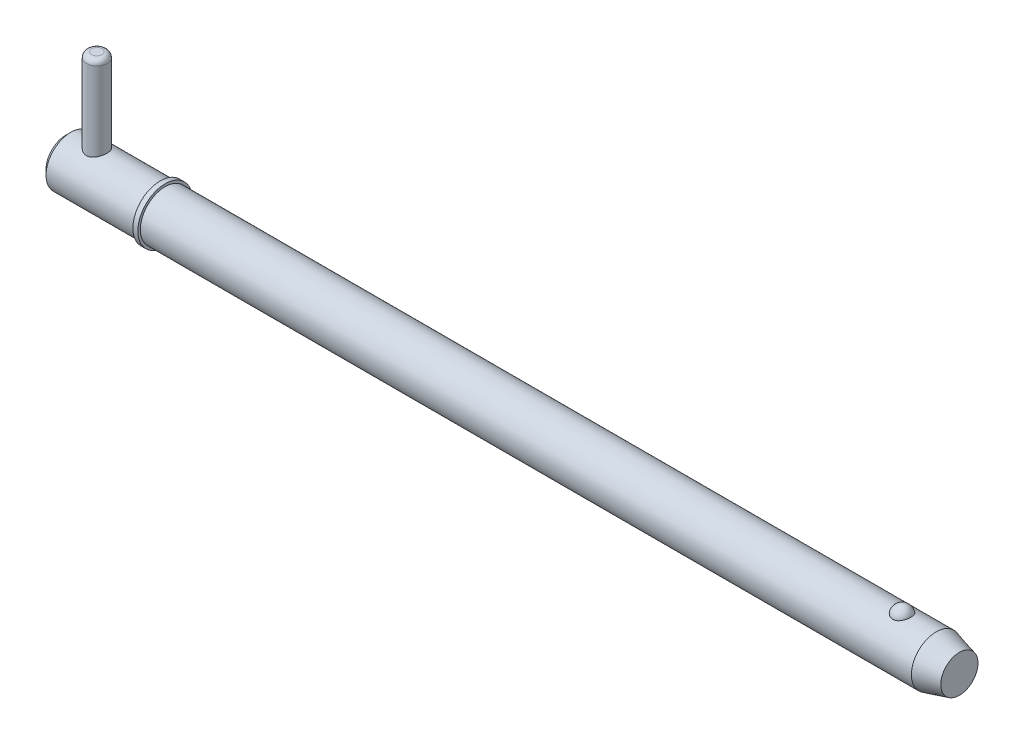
ISO-10303-21;
HEADER;
FILE_DESCRIPTION(('STEP AP214'),'2;1');
FILE_NAME('part.step','',(''),(''),'','','');
FILE_SCHEMA(('AUTOMOTIVE_DESIGN { 1 0 10303 214 1 1 1 1 }'));
ENDSEC;
DATA;
#1=APPLICATION_CONTEXT('core data for automotive mechanical design processes');
#2=APPLICATION_PROTOCOL_DEFINITION('international standard','automotive_design',2000,#1);
#3=PRODUCT_CONTEXT('',#1,'mechanical');
#4=PRODUCT('Part','Part','',(#3));
#5=PRODUCT_RELATED_PRODUCT_CATEGORY('part','',(#4));
#6=PRODUCT_DEFINITION_FORMATION('','',#4);
#7=PRODUCT_DEFINITION_CONTEXT('part definition',#1,'design');
#8=PRODUCT_DEFINITION('design','',#6,#7);
#9=PRODUCT_DEFINITION_SHAPE('','',#8);
#10=(LENGTH_UNIT() NAMED_UNIT(*) SI_UNIT(.MILLI.,.METRE.));
#11=(NAMED_UNIT(*) PLANE_ANGLE_UNIT() SI_UNIT($,.RADIAN.));
#12=(NAMED_UNIT(*) SI_UNIT($,.STERADIAN.) SOLID_ANGLE_UNIT());
#13=UNCERTAINTY_MEASURE_WITH_UNIT(LENGTH_MEASURE(1.E-05),#10,'distance_accuracy_value','');
#14=(GEOMETRIC_REPRESENTATION_CONTEXT(3) GLOBAL_UNCERTAINTY_ASSIGNED_CONTEXT((#13)) GLOBAL_UNIT_ASSIGNED_CONTEXT((#10,
#11,#12)) REPRESENTATION_CONTEXT('',''));
#15=CARTESIAN_POINT('',(0.,0.,0.));
#16=DIRECTION('',(0.,0.,1.));
#17=DIRECTION('',(1.,0.,0.));
#18=AXIS2_PLACEMENT_3D('',#15,#16,#17);
#19=CARTESIAN_POINT('',(5.94,20.635,0.));
#20=DIRECTION('',(0.,-1.,0.));
#21=DIRECTION('',(0.,0.,-1.));
#22=AXIS2_PLACEMENT_3D('',#19,#20,#21);
#23=CYLINDRICAL_SURFACE('',#22,1.98);
#24=CARTESIAN_POINT('',(5.94,-3.775,0.));
#25=DIRECTION('',(0.,1.,0.));
#26=DIRECTION('',(0.,0.,1.));
#27=AXIS2_PLACEMENT_3D('',#24,#25,#26);
#28=CIRCLE('',#27,1.98);
#29=CARTESIAN_POINT('',(5.94,-3.775,1.98));
#30=VERTEX_POINT('',#29);
#31=EDGE_CURVE('P0_E25',#30,#30,#28,.T.);
#32=ORIENTED_EDGE('',*,*,#31,.T.);
#33=EDGE_LOOP('',(#32));
#34=FACE_BOUND('',#33,.T.);
#35=CARTESIAN_POINT('',(5.94,19.645,0.));
#36=DIRECTION('',(0.,1.,0.));
#37=DIRECTION('',(0.,0.,1.));
#38=AXIS2_PLACEMENT_3D('',#35,#36,#37);
#39=CIRCLE('',#38,1.98);
#40=CARTESIAN_POINT('',(5.94,19.645,1.98));
#41=VERTEX_POINT('',#40);
#42=EDGE_CURVE('P0_E29',#41,#41,#39,.F.);
#43=ORIENTED_EDGE('',*,*,#42,.T.);
#44=EDGE_LOOP('',(#43));
#45=FACE_BOUND('',#44,.T.);
#46=ADVANCED_FACE('P0_F14',(#34,#45),#23,.T.);
#47=CARTESIAN_POINT('',(5.94,20.635,0.));
#48=DIRECTION('',(0.,1.,0.));
#49=DIRECTION('',(0.,0.,1.));
#50=AXIS2_PLACEMENT_3D('',#47,#48,#49);
#51=PLANE('',#50);
#52=CARTESIAN_POINT('',(5.94,20.635,0.));
#53=DIRECTION('',(0.,1.,0.));
#54=DIRECTION('',(0.,0.,1.));
#55=AXIS2_PLACEMENT_3D('',#52,#53,#54);
#56=CIRCLE('',#55,0.99);
#57=CARTESIAN_POINT('',(5.94,20.635,0.99));
#58=VERTEX_POINT('',#57);
#59=EDGE_CURVE('P0_E10',#58,#58,#56,.T.);
#60=ORIENTED_EDGE('',*,*,#59,.T.);
#61=EDGE_LOOP('',(#60));
#62=FACE_BOUND('',#61,.T.);
#63=ADVANCED_FACE('P0_F46',(#62),#51,.T.);
#64=CARTESIAN_POINT('',(5.94,-4.765,0.));
#65=DIRECTION('',(0.,1.,0.));
#66=DIRECTION('',(0.,0.,1.));
#67=AXIS2_PLACEMENT_3D('',#64,#65,#66);
#68=PLANE('',#67);
#69=CARTESIAN_POINT('',(5.94,-4.765,0.));
#70=DIRECTION('',(0.,1.,0.));
#71=DIRECTION('',(0.,0.,1.));
#72=AXIS2_PLACEMENT_3D('',#69,#70,#71);
#73=CIRCLE('',#72,0.99);
#74=CARTESIAN_POINT('',(5.94,-4.765,0.99));
#75=VERTEX_POINT('',#74);
#76=EDGE_CURVE('P0_E21',#75,#75,#73,.F.);
#77=ORIENTED_EDGE('',*,*,#76,.T.);
#78=EDGE_LOOP('',(#77));
#79=FACE_BOUND('',#78,.T.);
#80=ADVANCED_FACE('P0_F43',(#79),#68,.F.);
#81=CARTESIAN_POINT('',(5.94,-3.775,0.));
#82=DIRECTION('',(0.,1.,0.));
#83=DIRECTION('',(0.,0.,1.));
#84=AXIS2_PLACEMENT_3D('',#81,#82,#83);
#85=DEGENERATE_TOROIDAL_SURFACE('',#84,0.99,0.99,.T.);
#86=ORIENTED_EDGE('',*,*,#76,.F.);
#87=EDGE_LOOP('',(#86));
#88=FACE_BOUND('',#87,.T.);
#89=ORIENTED_EDGE('',*,*,#31,.F.);
#90=EDGE_LOOP('',(#89));
#91=FACE_BOUND('',#90,.T.);
#92=ADVANCED_FACE('P0_F38',(#88,#91),#85,.T.);
#93=CARTESIAN_POINT('',(5.94,19.645,0.));
#94=DIRECTION('',(0.,1.,0.));
#95=DIRECTION('',(0.,0.,1.));
#96=AXIS2_PLACEMENT_3D('',#93,#94,#95);
#97=DEGENERATE_TOROIDAL_SURFACE('',#96,0.99,0.99,.T.);
#98=ORIENTED_EDGE('',*,*,#42,.F.);
#99=EDGE_LOOP('',(#98));
#100=FACE_BOUND('',#99,.T.);
#101=ORIENTED_EDGE('',*,*,#59,.F.);
#102=EDGE_LOOP('',(#101));
#103=FACE_BOUND('',#102,.T.);
#104=ADVANCED_FACE('P0_F16',(#100,#103),#97,.T.);
#105=CLOSED_SHELL('',(#46,#63,#80,#92,#104));
#106=MANIFOLD_SOLID_BREP('P0_B1',#105);
#107=CARTESIAN_POINT('',(0.,0.,0.));
#108=DIRECTION('',(1.,0.,0.));
#109=DIRECTION('',(0.,0.,-1.));
#110=AXIS2_PLACEMENT_3D('',#107,#108,#109);
#111=CYLINDRICAL_SURFACE('',#110,4.765);
#112=CARTESIAN_POINT('',(167.004194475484,0.,0.));
#113=DIRECTION('',(1.,0.,0.));
#114=DIRECTION('',(0.,0.,-1.));
#115=AXIS2_PLACEMENT_3D('',#112,#113,#114);
#116=CIRCLE('',#115,4.765);
#117=CARTESIAN_POINT('',(167.004194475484,0.,-4.765));
#118=VERTEX_POINT('',#117);
#119=EDGE_CURVE('P1_E81',#118,#118,#116,.T.);
#120=ORIENTED_EDGE('',*,*,#119,.F.);
#121=EDGE_LOOP('',(#120));
#122=FACE_BOUND('',#121,.T.);
#123=CARTESIAN_POINT('',(19.05,0.,0.));
#124=DIRECTION('',(1.,0.,0.));
#125=DIRECTION('',(0.,0.,-1.));
#126=AXIS2_PLACEMENT_3D('',#123,#124,#125);
#127=CIRCLE('',#126,4.765);
#128=CARTESIAN_POINT('',(19.05,0.,-4.765));
#129=VERTEX_POINT('',#128);
#130=EDGE_CURVE('P1_E85',#129,#129,#127,.T.);
#131=ORIENTED_EDGE('',*,*,#130,.T.);
#132=EDGE_LOOP('',(#131));
#133=FACE_BOUND('',#132,.T.);
#134=CARTESIAN_POINT('',(160.451020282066,4.42764777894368,1.76101111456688));
#135=CARTESIAN_POINT('',(160.359721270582,4.42764470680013,1.76101422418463));
#136=CARTESIAN_POINT('',(160.268446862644,4.43059091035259,1.75366340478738));
#137=CARTESIAN_POINT('',(160.088615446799,4.44201846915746,1.72451180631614));
#138=CARTESIAN_POINT('',(160.000057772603,4.45049845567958,1.70271460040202));
#139=CARTESIAN_POINT('',(159.828257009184,4.47200516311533,1.64539370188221));
#140=CARTESIAN_POINT('',(159.745006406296,4.48502527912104,1.60988994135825));
#141=CARTESIAN_POINT('',(159.585763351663,4.51419542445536,1.52617873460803));
#142=CARTESIAN_POINT('',(159.509772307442,4.53034605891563,1.47796883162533));
#143=CARTESIAN_POINT('',(159.364744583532,4.56459317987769,1.36860494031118));
#144=CARTESIAN_POINT('',(159.295964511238,4.58273170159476,1.30712420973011));
#145=CARTESIAN_POINT('',(159.169342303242,4.61870302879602,1.17370204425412));
#146=CARTESIAN_POINT('',(159.111502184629,4.63653577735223,1.10175868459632));
#147=CARTESIAN_POINT('',(159.005570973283,4.67090140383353,0.945806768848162));
#148=CARTESIAN_POINT('',(158.958030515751,4.68734068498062,0.861402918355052));
#149=CARTESIAN_POINT('',(158.877081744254,4.71628466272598,0.685442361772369));
#150=CARTESIAN_POINT('',(158.843674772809,4.72878898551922,0.593884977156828));
#151=CARTESIAN_POINT('',(158.791287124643,4.74874061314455,0.404781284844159));
#152=CARTESIAN_POINT('',(158.772517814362,4.75611366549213,0.307168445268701));
#153=CARTESIAN_POINT('',(158.750584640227,4.76475393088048,0.109940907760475));
#154=CARTESIAN_POINT('',(158.747420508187,4.76602124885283,0.0103262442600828));
#155=CARTESIAN_POINT('',(158.756740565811,4.76232928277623,-0.187629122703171));
#156=CARTESIAN_POINT('',(158.769158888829,4.7573962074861,-0.285973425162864));
#157=CARTESIAN_POINT('',(158.809280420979,4.74184975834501,-0.479027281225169));
#158=CARTESIAN_POINT('',(158.836983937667,4.7312362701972,-0.573736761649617));
#159=CARTESIAN_POINT('',(158.907158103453,4.70540026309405,-0.756973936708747));
#160=CARTESIAN_POINT('',(158.949646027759,4.69017235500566,-0.845494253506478));
#161=CARTESIAN_POINT('',(159.048520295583,4.65669867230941,-1.01378033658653));
#162=CARTESIAN_POINT('',(159.104907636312,4.63845268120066,-1.09354547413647));
#163=CARTESIAN_POINT('',(159.230552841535,4.60085438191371,-1.24228523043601));
#164=CARTESIAN_POINT('',(159.299843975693,4.58149930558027,-1.31123108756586));
#165=CARTESIAN_POINT('',(159.449606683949,4.54391653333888,-1.43607409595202));
#166=CARTESIAN_POINT('',(159.530077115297,4.52568872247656,-1.49197257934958));
#167=CARTESIAN_POINT('',(159.698150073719,4.49293007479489,-1.58786764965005));
#168=CARTESIAN_POINT('',(159.785544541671,4.47832346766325,-1.62820219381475));
#169=CARTESIAN_POINT('',(159.966553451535,4.45406011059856,-1.69345757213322));
#170=CARTESIAN_POINT('',(160.06016555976,4.44440151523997,-1.71838415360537));
#171=CARTESIAN_POINT('',(160.245893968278,4.43159888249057,-1.75112843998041));
#172=CARTESIAN_POINT('',(160.337849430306,4.42815213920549,-1.75974223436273));
#173=CARTESIAN_POINT('',(160.521965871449,4.427247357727,-1.76201865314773));
#174=CARTESIAN_POINT('',(160.614126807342,4.42978816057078,-1.7556841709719));
#175=CARTESIAN_POINT('',(160.793129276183,4.44038648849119,-1.72869560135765));
#176=CARTESIAN_POINT('',(160.880047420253,4.44827555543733,-1.70847853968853));
#177=CARTESIAN_POINT('',(161.049131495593,4.46852246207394,-1.65479562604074));
#178=CARTESIAN_POINT('',(161.131297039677,4.48088066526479,-1.62132869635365));
#179=CARTESIAN_POINT('',(161.290591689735,4.50907357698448,-1.54120560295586));
#180=CARTESIAN_POINT('',(161.367570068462,4.52497884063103,-1.49427526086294));
#181=CARTESIAN_POINT('',(161.512708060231,4.55845148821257,-1.38881222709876));
#182=CARTESIAN_POINT('',(161.580865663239,4.57601924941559,-1.33027689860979));
#183=CARTESIAN_POINT('',(161.710099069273,4.61196537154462,-1.1999104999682));
#184=CARTESIAN_POINT('',(161.770656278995,4.63034074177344,-1.12756415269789));
#185=CARTESIAN_POINT('',(161.879279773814,4.66513959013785,-0.97361299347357));
#186=CARTESIAN_POINT('',(161.927343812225,4.68156271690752,-0.892006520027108));
#187=CARTESIAN_POINT('',(162.011383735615,4.71130224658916,-0.718892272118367));
#188=CARTESIAN_POINT('',(162.046918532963,4.724501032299,-0.627149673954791));
#189=CARTESIAN_POINT('',(162.102952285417,4.74571823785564,-0.438611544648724));
#190=CARTESIAN_POINT('',(162.123450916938,4.75373654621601,-0.34181590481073));
#191=CARTESIAN_POINT('',(162.149033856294,4.76378905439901,-0.14563306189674));
#192=CARTESIAN_POINT('',(162.154076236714,4.76580697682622,-0.0462395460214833));
#193=CARTESIAN_POINT('',(162.148523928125,4.7636057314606,0.152038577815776));
#194=CARTESIAN_POINT('',(162.137929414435,4.75938663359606,0.250923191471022));
#195=CARTESIAN_POINT('',(162.101387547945,4.74516937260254,0.445004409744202));
#196=CARTESIAN_POINT('',(162.075496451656,4.73519238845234,0.540213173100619));
#197=CARTESIAN_POINT('',(162.008927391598,4.71049394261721,0.724662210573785));
#198=CARTESIAN_POINT('',(161.968248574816,4.69577220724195,0.813902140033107));
#199=CARTESIAN_POINT('',(161.872717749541,4.66303767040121,0.984313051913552));
#200=CARTESIAN_POINT('',(161.817804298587,4.64501070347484,1.06544688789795));
#201=CARTESIAN_POINT('',(161.695049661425,4.60764678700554,1.21692673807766));
#202=CARTESIAN_POINT('',(161.627208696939,4.58830985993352,1.28727293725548));
#203=CARTESIAN_POINT('',(161.480548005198,4.55060370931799,1.41479271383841));
#204=CARTESIAN_POINT('',(161.401791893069,4.53222967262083,1.47203785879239));
#205=CARTESIAN_POINT('',(161.234989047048,4.49849576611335,1.57212016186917));
#206=CARTESIAN_POINT('',(161.146941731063,4.48313608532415,1.6149564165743));
#207=CARTESIAN_POINT('',(160.959791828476,4.45676184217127,1.68642657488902));
#208=CARTESIAN_POINT('',(160.860365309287,4.44598302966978,1.71430590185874));
#209=CARTESIAN_POINT('',(160.657621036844,4.43142918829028,1.7515925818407));
#210=CARTESIAN_POINT('',(160.554304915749,4.42765125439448,1.76100759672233));
#211=CARTESIAN_POINT('',(160.451020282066,4.42764777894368,1.76101111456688));
#212=B_SPLINE_CURVE_WITH_KNOTS('',3,(#134,#135,#136,#137,#138,#139,#140,#141,#142,#143,#144,
#145,#146,#147,#148,#149,#150,#151,#152,#153,#154,#155,#156,#157,#158,#159,#160,#161,#162,#163,
#164,#165,#166,#167,#168,#169,#170,#171,#172,#173,#174,#175,#176,#177,#178,#179,#180,#181,#182,
#183,#184,#185,#186,#187,#188,#189,#190,#191,#192,#193,#194,#195,#196,#197,#198,#199,#200,#201,
#202,#203,#204,#205,#206,#207,#208,#209,#210,#211),.UNSPECIFIED.,.T.,.F.,(4,2,2,2,2,2,2,2,2,2,2,
2,2,2,2,2,2,2,2,2,2,2,2,2,2,2,2,2,2,2,2,2,2,2,2,2,2,2,4),(0.,0.273517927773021,
0.546968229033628,0.820022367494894,1.09312934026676,1.37393946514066,1.6548013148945,
1.94820420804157,2.24163496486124,2.53922817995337,2.83681628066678,3.13315071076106,
3.42949110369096,3.72617893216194,4.02288805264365,4.32037303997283,4.61782764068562,
4.90840095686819,5.19886582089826,5.47474855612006,5.75057789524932,6.0180997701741,
6.28564340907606,6.55907787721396,6.83257454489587,7.11962987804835,7.40673679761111,
7.70312663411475,7.9995228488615,8.29672237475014,8.59391856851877,8.89002850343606,
9.18615552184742,9.48358266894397,9.7810047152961,10.0767610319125,10.3725358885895,
10.6820893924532,10.991514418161),.UNSPECIFIED.);
#213=CARTESIAN_POINT('',(160.451020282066,4.42764777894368,1.76101111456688));
#214=VERTEX_POINT('',#213);
#215=EDGE_CURVE('P1_E35',#214,#214,#212,.T.);
#216=ORIENTED_EDGE('',*,*,#215,.T.);
#217=EDGE_LOOP('',(#216));
#218=FACE_BOUND('',#217,.T.);
#219=ADVANCED_FACE('P1_F13',(#122,#133,#218),#111,.T.);
#220=CARTESIAN_POINT('',(0.,0.,0.));
#221=DIRECTION('',(-1.,0.,0.));
#222=DIRECTION('',(0.,0.,1.));
#223=AXIS2_PLACEMENT_3D('',#220,#221,#222);
#224=PLANE('',#223);
#225=CARTESIAN_POINT('',(0.,0.,0.));
#226=DIRECTION('',(1.,0.,0.));
#227=DIRECTION('',(0.,0.,-1.));
#228=AXIS2_PLACEMENT_3D('',#225,#226,#227);
#229=CIRCLE('',#228,3.812);
#230=CARTESIAN_POINT('',(0.,0.,-3.812));
#231=VERTEX_POINT('',#230);
#232=EDGE_CURVE('P1_E9',#231,#231,#229,.T.);
#233=ORIENTED_EDGE('',*,*,#232,.F.);
#234=EDGE_LOOP('',(#233));
#235=FACE_BOUND('',#234,.T.);
#236=ADVANCED_FACE('P1_F15',(#235),#224,.T.);
#237=CARTESIAN_POINT('',(0.952999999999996,0.,0.));
#238=DIRECTION('',(1.,0.,0.));
#239=DIRECTION('',(0.,0.,-1.));
#240=AXIS2_PLACEMENT_3D('',#237,#238,#239);
#241=CONICAL_SURFACE('',#240,4.765,0.78539816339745);
#242=ORIENTED_EDGE('',*,*,#232,.T.);
#243=EDGE_LOOP('',(#242));
#244=FACE_BOUND('',#243,.T.);
#245=CARTESIAN_POINT('',(0.952999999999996,0.,0.));
#246=DIRECTION('',(1.,0.,0.));
#247=DIRECTION('',(0.,0.,-1.));
#248=AXIS2_PLACEMENT_3D('',#245,#246,#247);
#249=CIRCLE('',#248,4.765);
#250=CARTESIAN_POINT('',(0.952999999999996,0.,-4.765));
#251=VERTEX_POINT('',#250);
#252=EDGE_CURVE('P1_E26',#251,#251,#249,.T.);
#253=ORIENTED_EDGE('',*,*,#252,.F.);
#254=EDGE_LOOP('',(#253));
#255=FACE_BOUND('',#254,.T.);
#256=ADVANCED_FACE('P1_F77',(#244,#255),#241,.T.);
#257=CARTESIAN_POINT('',(0.,0.,0.));
#258=DIRECTION('',(1.,0.,0.));
#259=DIRECTION('',(0.,0.,-1.));
#260=AXIS2_PLACEMENT_3D('',#257,#258,#259);
#261=CYLINDRICAL_SURFACE('',#260,4.765);
#262=CARTESIAN_POINT('',(5.94,-4.33414639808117,1.98));
#263=CARTESIAN_POINT('',(5.83435484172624,-4.33415447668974,1.97999169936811));
#264=CARTESIAN_POINT('',(5.72854887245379,-4.33806396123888,1.97149330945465));
#265=CARTESIAN_POINT('',(5.51998191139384,-4.35319906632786,1.93783487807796));
#266=CARTESIAN_POINT('',(5.41723000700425,-4.3644446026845,1.91262947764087));
#267=CARTESIAN_POINT('',(5.21817294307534,-4.39274225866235,1.84670269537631));
#268=CARTESIAN_POINT('',(5.12184344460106,-4.40977076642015,1.80604432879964));
#269=CARTESIAN_POINT('',(4.93740039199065,-4.44768106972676,1.71055160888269));
#270=CARTESIAN_POINT('',(4.84928487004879,-4.46856193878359,1.65572066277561));
#271=CARTESIAN_POINT('',(4.67826533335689,-4.51326966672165,1.52981120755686));
#272=CARTESIAN_POINT('',(4.59593118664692,-4.53719608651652,1.45799365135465));
#273=CARTESIAN_POINT('',(4.44405452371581,-4.58448035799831,1.30170177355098));
#274=CARTESIAN_POINT('',(4.37451692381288,-4.60783798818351,1.21722260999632));
#275=CARTESIAN_POINT('',(4.24730683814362,-4.65256187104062,1.03353484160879));
#276=CARTESIAN_POINT('',(4.19027484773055,-4.67379892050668,0.933848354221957));
#277=CARTESIAN_POINT('',(4.0940363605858,-4.7106711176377,0.7252544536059));
#278=CARTESIAN_POINT('',(4.05482199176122,-4.72630873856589,0.61635113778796));
#279=CARTESIAN_POINT('',(3.99739515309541,-4.74951416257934,0.398397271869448));
#280=CARTESIAN_POINT('',(3.97820018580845,-4.7574579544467,0.289646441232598));
#281=CARTESIAN_POINT('',(3.95818309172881,-4.76574596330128,0.0701967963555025));
#282=CARTESIAN_POINT('',(3.95735355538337,-4.76609324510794,-0.0405012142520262));
#283=CARTESIAN_POINT('',(3.9735743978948,-4.75937098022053,-0.253561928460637));
#284=CARTESIAN_POINT('',(3.98954548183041,-4.75274912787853,-0.356023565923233));
#285=CARTESIAN_POINT('',(4.03706504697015,-4.73344665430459,-0.556659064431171));
#286=CARTESIAN_POINT('',(4.06861467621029,-4.72076558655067,-0.654832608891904));
#287=CARTESIAN_POINT('',(4.14677192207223,-4.69032846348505,-0.845904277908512));
#288=CARTESIAN_POINT('',(4.19360181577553,-4.67249797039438,-0.938699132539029));
#289=CARTESIAN_POINT('',(4.30077315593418,-4.63350852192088,-1.11535616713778));
#290=CARTESIAN_POINT('',(4.3611193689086,-4.61234839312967,-1.19921518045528));
#291=CARTESIAN_POINT('',(4.49853487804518,-4.56707259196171,-1.3618711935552));
#292=CARTESIAN_POINT('',(4.57648039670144,-4.5428537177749,-1.43990029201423));
#293=CARTESIAN_POINT('',(4.74440779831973,-4.49530722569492,-1.58211009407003));
#294=CARTESIAN_POINT('',(4.83439425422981,-4.47197995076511,-1.64628551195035));
#295=CARTESIAN_POINT('',(5.02755026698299,-4.42812342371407,-1.76092221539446));
#296=CARTESIAN_POINT('',(5.13105348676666,-4.40770990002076,-1.81086937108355));
#297=CARTESIAN_POINT('',(5.34607555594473,-4.37336901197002,-1.89231211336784));
#298=CARTESIAN_POINT('',(5.45758864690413,-4.3594370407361,-1.92382080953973));
#299=CARTESIAN_POINT('',(5.67777275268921,-4.34077746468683,-1.96554536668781));
#300=CARTESIAN_POINT('',(5.78616167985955,-4.33551319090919,-1.9770057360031));
#301=CARTESIAN_POINT('',(6.00341835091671,-4.33325118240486,-1.98196183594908));
#302=CARTESIAN_POINT('',(6.11228591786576,-4.33625061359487,-1.97546372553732));
#303=CARTESIAN_POINT('',(6.32012423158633,-4.34962383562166,-1.94582288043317));
#304=CARTESIAN_POINT('',(6.41928436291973,-4.35951709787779,-1.92376364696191));
#305=CARTESIAN_POINT('',(6.61241543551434,-4.38495043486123,-1.86506038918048));
#306=CARTESIAN_POINT('',(6.70638516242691,-4.40049182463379,-1.82841296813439));
#307=CARTESIAN_POINT('',(6.89090272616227,-4.43627016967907,-1.73985559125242));
#308=CARTESIAN_POINT('',(6.98113841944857,-4.45667771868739,-1.68736639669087));
#309=CARTESIAN_POINT('',(7.1519532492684,-4.49964530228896,-1.56919282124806));
#310=CARTESIAN_POINT('',(7.232528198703,-4.52220626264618,-1.50350275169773));
#311=CARTESIAN_POINT('',(7.38851617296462,-4.56914071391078,-1.35452895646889));
#312=CARTESIAN_POINT('',(7.46298462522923,-4.5935132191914,-1.27025197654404));
#313=CARTESIAN_POINT('',(7.59689029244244,-4.63962841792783,-1.08983181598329));
#314=CARTESIAN_POINT('',(7.65632644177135,-4.66137092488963,-0.993687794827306));
#315=CARTESIAN_POINT('',(7.75840361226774,-4.69991192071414,-0.791608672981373));
#316=CARTESIAN_POINT('',(7.80100481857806,-4.71669866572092,-0.685651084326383));
#317=CARTESIAN_POINT('',(7.86746997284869,-4.74331408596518,-0.467197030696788));
#318=CARTESIAN_POINT('',(7.8913450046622,-4.75314687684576,-0.354704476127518));
#319=CARTESIAN_POINT('',(7.91828971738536,-4.76427543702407,-0.134819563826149));
#320=CARTESIAN_POINT('',(7.92269147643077,-4.76611762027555,-0.027616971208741));
#321=CARTESIAN_POINT('',(7.91414154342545,-4.76256684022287,0.185959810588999));
#322=CARTESIAN_POINT('',(7.90119286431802,-4.75717513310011,0.292334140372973));
#323=CARTESIAN_POINT('',(7.85926572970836,-4.74004856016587,0.497383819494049));
#324=CARTESIAN_POINT('',(7.83086647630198,-4.72854322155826,0.596198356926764));
#325=CARTESIAN_POINT('',(7.75947503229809,-4.70045111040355,0.787624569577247));
#326=CARTESIAN_POINT('',(7.71648006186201,-4.68386336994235,0.880235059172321));
#327=CARTESIAN_POINT('',(7.6149456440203,-4.64628321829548,1.06122875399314));
#328=CARTESIAN_POINT('',(7.55579211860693,-4.62512577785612,1.14923242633));
#329=CARTESIAN_POINT('',(7.42451813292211,-4.58091700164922,1.31443888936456));
#330=CARTESIAN_POINT('',(7.35239289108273,-4.5578649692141,1.39163767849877));
#331=CARTESIAN_POINT('',(7.19146107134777,-4.51050832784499,1.53847013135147));
#332=CARTESIAN_POINT('',(7.10185635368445,-4.48622440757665,1.60723941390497));
#333=CARTESIAN_POINT('',(6.91164948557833,-4.44076541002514,1.72888900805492));
#334=CARTESIAN_POINT('',(6.81104124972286,-4.41959206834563,1.78176046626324));
#335=CARTESIAN_POINT('',(6.60181953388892,-4.38318936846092,1.86953227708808));
#336=CARTESIAN_POINT('',(6.49325511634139,-4.3679267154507,1.90453365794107));
#337=CARTESIAN_POINT('',(6.32681512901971,-4.35102038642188,1.94268459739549));
#338=CARTESIAN_POINT('',(6.27079191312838,-4.34638447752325,1.953006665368));
#339=CARTESIAN_POINT('',(6.15793999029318,-4.33925923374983,1.96879053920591));
#340=CARTESIAN_POINT('',(6.10111188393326,-4.33676837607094,1.97425579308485));
#341=CARTESIAN_POINT('',(6.00947316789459,-4.33456308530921,1.97908711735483));
#342=CARTESIAN_POINT('',(5.97474528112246,-4.33414374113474,1.98000272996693));
#343=CARTESIAN_POINT('',(5.94,-4.33414639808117,1.98));
#344=B_SPLINE_CURVE_WITH_KNOTS('',3,(#262,#263,#264,#265,#266,#267,#268,#269,#270,#271,#272,
#273,#274,#275,#276,#277,#278,#279,#280,#281,#282,#283,#284,#285,#286,#287,#288,#289,#290,#291,
#292,#293,#294,#295,#296,#297,#298,#299,#300,#301,#302,#303,#304,#305,#306,#307,#308,#309,#310,
#311,#312,#313,#314,#315,#316,#317,#318,#319,#320,#321,#322,#323,#324,#325,#326,#327,#328,#329,
#330,#331,#332,#333,#334,#335,#336,#337,#338,#339,#340,#341,#342,#343),.UNSPECIFIED.,.T.,.F.,(4,
2,2,2,2,2,2,2,2,2,2,2,2,2,2,2,2,2,2,2,2,2,2,2,2,2,2,2,2,2,2,2,2,2,2,2,2,2,2,2,4),(0.,
0.316814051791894,0.634491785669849,0.950887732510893,1.2672076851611,1.60127705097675,
1.93547449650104,2.28407463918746,2.63252061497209,2.96292077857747,3.29318763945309,
3.60346227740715,3.91375978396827,4.22878888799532,4.54392926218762,4.88117914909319,
5.21855748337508,5.56691259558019,5.91501972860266,6.24062939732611,6.56612741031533,
6.87094948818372,7.17584258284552,7.49361276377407,7.81152017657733,8.15513975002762,
8.4987836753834,8.8432355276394,9.18748334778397,9.50777781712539,9.8280166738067,
10.1370037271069,10.4460496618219,10.7690461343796,11.0921619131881,11.4371238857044,
11.7822776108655,12.1254577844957,12.2967183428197,12.4678572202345,12.5720531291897),.UNSPECIFIED.);
#345=CARTESIAN_POINT('',(5.94,-4.33414639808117,1.98));
#346=VERTEX_POINT('',#345);
#347=EDGE_CURVE('P1_E17',#346,#346,#344,.T.);
#348=ORIENTED_EDGE('',*,*,#347,.F.);
#349=EDGE_LOOP('',(#348));
#350=FACE_BOUND('',#349,.T.);
#351=CARTESIAN_POINT('',(5.94,4.33414639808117,1.98));
#352=CARTESIAN_POINT('',(6.04564515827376,4.33415447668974,1.97999169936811));
#353=CARTESIAN_POINT('',(6.15145112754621,4.33806396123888,1.97149330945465));
#354=CARTESIAN_POINT('',(6.36001808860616,4.35319906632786,1.93783487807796));
#355=CARTESIAN_POINT('',(6.46276999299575,4.3644446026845,1.91262947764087));
#356=CARTESIAN_POINT('',(6.66182705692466,4.39274225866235,1.84670269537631));
#357=CARTESIAN_POINT('',(6.75815655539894,4.40977076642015,1.80604432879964));
#358=CARTESIAN_POINT('',(6.94259960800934,4.44768106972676,1.71055160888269));
#359=CARTESIAN_POINT('',(7.03071512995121,4.46856193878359,1.65572066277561));
#360=CARTESIAN_POINT('',(7.20173466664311,4.51326966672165,1.52981120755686));
#361=CARTESIAN_POINT('',(7.28406881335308,4.53719608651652,1.45799365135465));
#362=CARTESIAN_POINT('',(7.43594547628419,4.58448035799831,1.30170177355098));
#363=CARTESIAN_POINT('',(7.50548307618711,4.60783798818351,1.21722260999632));
#364=CARTESIAN_POINT('',(7.63269316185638,4.65256187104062,1.03353484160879));
#365=CARTESIAN_POINT('',(7.68972515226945,4.67379892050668,0.933848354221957));
#366=CARTESIAN_POINT('',(7.7859636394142,4.7106711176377,0.7252544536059));
#367=CARTESIAN_POINT('',(7.82517800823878,4.72630873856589,0.61635113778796));
#368=CARTESIAN_POINT('',(7.88260484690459,4.74951416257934,0.398397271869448));
#369=CARTESIAN_POINT('',(7.90179981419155,4.7574579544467,0.289646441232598));
#370=CARTESIAN_POINT('',(7.92181690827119,4.76574596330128,0.0701967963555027));
#371=CARTESIAN_POINT('',(7.92264644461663,4.76609324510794,-0.040501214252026));
#372=CARTESIAN_POINT('',(7.9064256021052,4.75937098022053,-0.253561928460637));
#373=CARTESIAN_POINT('',(7.89045451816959,4.75274912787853,-0.356023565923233));
#374=CARTESIAN_POINT('',(7.84293495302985,4.73344665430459,-0.55665906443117));
#375=CARTESIAN_POINT('',(7.81138532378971,4.72076558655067,-0.654832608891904));
#376=CARTESIAN_POINT('',(7.73322807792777,4.69032846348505,-0.845904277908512));
#377=CARTESIAN_POINT('',(7.68639818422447,4.67249797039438,-0.938699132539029));
#378=CARTESIAN_POINT('',(7.57922684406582,4.63350852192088,-1.11535616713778));
#379=CARTESIAN_POINT('',(7.5188806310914,4.61234839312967,-1.19921518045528));
#380=CARTESIAN_POINT('',(7.38146512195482,4.56707259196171,-1.3618711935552));
#381=CARTESIAN_POINT('',(7.30351960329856,4.5428537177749,-1.43990029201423));
#382=CARTESIAN_POINT('',(7.13559220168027,4.49530722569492,-1.58211009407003));
#383=CARTESIAN_POINT('',(7.04560574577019,4.47197995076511,-1.64628551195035));
#384=CARTESIAN_POINT('',(6.85244973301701,4.42812342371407,-1.76092221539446));
#385=CARTESIAN_POINT('',(6.74894651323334,4.40770990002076,-1.81086937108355));
#386=CARTESIAN_POINT('',(6.53392444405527,4.37336901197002,-1.89231211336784));
#387=CARTESIAN_POINT('',(6.42241135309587,4.3594370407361,-1.92382080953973));
#388=CARTESIAN_POINT('',(6.20222724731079,4.34077746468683,-1.96554536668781));
#389=CARTESIAN_POINT('',(6.09383832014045,4.33551319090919,-1.9770057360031));
#390=CARTESIAN_POINT('',(5.87658164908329,4.33325118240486,-1.98196183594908));
#391=CARTESIAN_POINT('',(5.76771408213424,4.33625061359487,-1.97546372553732));
#392=CARTESIAN_POINT('',(5.55987576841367,4.34962383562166,-1.94582288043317));
#393=CARTESIAN_POINT('',(5.46071563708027,4.35951709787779,-1.92376364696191));
#394=CARTESIAN_POINT('',(5.26758456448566,4.38495043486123,-1.86506038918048));
#395=CARTESIAN_POINT('',(5.17361483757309,4.40049182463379,-1.82841296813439));
#396=CARTESIAN_POINT('',(4.98909727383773,4.43627016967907,-1.73985559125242));
#397=CARTESIAN_POINT('',(4.89886158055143,4.45667771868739,-1.68736639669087));
#398=CARTESIAN_POINT('',(4.72804675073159,4.49964530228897,-1.56919282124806));
#399=CARTESIAN_POINT('',(4.647471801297,4.52220626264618,-1.50350275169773));
#400=CARTESIAN_POINT('',(4.49148382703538,4.56914071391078,-1.35452895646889));
#401=CARTESIAN_POINT('',(4.41701537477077,4.5935132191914,-1.27025197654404));
#402=CARTESIAN_POINT('',(4.28310970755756,4.63962841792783,-1.08983181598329));
#403=CARTESIAN_POINT('',(4.22367355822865,4.66137092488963,-0.993687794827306));
#404=CARTESIAN_POINT('',(4.12159638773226,4.69991192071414,-0.791608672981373));
#405=CARTESIAN_POINT('',(4.07899518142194,4.71669866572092,-0.685651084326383));
#406=CARTESIAN_POINT('',(4.01253002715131,4.74331408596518,-0.467197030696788));
#407=CARTESIAN_POINT('',(3.98865499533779,4.75314687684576,-0.354704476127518));
#408=CARTESIAN_POINT('',(3.96171028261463,4.76427543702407,-0.134819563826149));
#409=CARTESIAN_POINT('',(3.95730852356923,4.76611762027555,-0.0276169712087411));
#410=CARTESIAN_POINT('',(3.96585845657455,4.76256684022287,0.185959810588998));
#411=CARTESIAN_POINT('',(3.97880713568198,4.75717513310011,0.292334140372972));
#412=CARTESIAN_POINT('',(4.02073427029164,4.74004856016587,0.497383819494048));
#413=CARTESIAN_POINT('',(4.04913352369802,4.72854322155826,0.596198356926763));
#414=CARTESIAN_POINT('',(4.12052496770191,4.70045111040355,0.787624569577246));
#415=CARTESIAN_POINT('',(4.16351993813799,4.68386336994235,0.880235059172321));
#416=CARTESIAN_POINT('',(4.2650543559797,4.64628321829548,1.06122875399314));
#417=CARTESIAN_POINT('',(4.32420788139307,4.62512577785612,1.14923242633));
#418=CARTESIAN_POINT('',(4.45548186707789,4.58091700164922,1.31443888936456));
#419=CARTESIAN_POINT('',(4.52760710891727,4.5578649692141,1.39163767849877));
#420=CARTESIAN_POINT('',(4.68853892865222,4.51050832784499,1.53847013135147));
#421=CARTESIAN_POINT('',(4.77814364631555,4.48622440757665,1.60723941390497));
#422=CARTESIAN_POINT('',(4.96835051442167,4.44076541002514,1.72888900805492));
#423=CARTESIAN_POINT('',(5.06895875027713,4.41959206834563,1.78176046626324));
#424=CARTESIAN_POINT('',(5.27818046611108,4.38318936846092,1.86953227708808));
#425=CARTESIAN_POINT('',(5.38674488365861,4.3679267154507,1.90453365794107));
#426=CARTESIAN_POINT('',(5.55318487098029,4.35102038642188,1.94268459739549));
#427=CARTESIAN_POINT('',(5.60920808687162,4.34638447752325,1.953006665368));
#428=CARTESIAN_POINT('',(5.72206000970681,4.33925923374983,1.96879053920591));
#429=CARTESIAN_POINT('',(5.77888811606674,4.33676837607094,1.97425579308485));
#430=CARTESIAN_POINT('',(5.87052683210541,4.33456308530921,1.97908711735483));
#431=CARTESIAN_POINT('',(5.90525471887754,4.33414374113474,1.98000272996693));
#432=CARTESIAN_POINT('',(5.94,4.33414639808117,1.98));
#433=B_SPLINE_CURVE_WITH_KNOTS('',3,(#351,#352,#353,#354,#355,#356,#357,#358,#359,#360,#361,
#362,#363,#364,#365,#366,#367,#368,#369,#370,#371,#372,#373,#374,#375,#376,#377,#378,#379,#380,
#381,#382,#383,#384,#385,#386,#387,#388,#389,#390,#391,#392,#393,#394,#395,#396,#397,#398,#399,
#400,#401,#402,#403,#404,#405,#406,#407,#408,#409,#410,#411,#412,#413,#414,#415,#416,#417,#418,
#419,#420,#421,#422,#423,#424,#425,#426,#427,#428,#429,#430,#431,#432),.UNSPECIFIED.,.T.,.F.,(4,
2,2,2,2,2,2,2,2,2,2,2,2,2,2,2,2,2,2,2,2,2,2,2,2,2,2,2,2,2,2,2,2,2,2,2,2,2,2,2,4),(0.,
0.316814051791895,0.634491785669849,0.950887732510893,1.2672076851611,1.60127705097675,
1.93547449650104,2.28407463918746,2.63252061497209,2.96292077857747,3.29318763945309,
3.60346227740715,3.91375978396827,4.22878888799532,4.54392926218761,4.88117914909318,
5.21855748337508,5.56691259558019,5.91501972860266,6.24062939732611,6.56612741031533,
6.87094948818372,7.17584258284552,7.49361276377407,7.81152017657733,8.15513975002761,
8.4987836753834,8.84323552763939,9.18748334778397,9.50777781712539,9.8280166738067,
10.1370037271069,10.4460496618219,10.7690461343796,11.0921619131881,11.4371238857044,
11.7822776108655,12.1254577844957,12.2967183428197,12.4678572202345,12.5720531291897),.UNSPECIFIED.);
#434=CARTESIAN_POINT('',(5.94,4.33414639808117,1.98));
#435=VERTEX_POINT('',#434);
#436=EDGE_CURVE('P1_E43',#435,#435,#433,.T.);
#437=ORIENTED_EDGE('',*,*,#436,.F.);
#438=EDGE_LOOP('',(#437));
#439=FACE_BOUND('',#438,.T.);
#440=ORIENTED_EDGE('',*,*,#252,.T.);
#441=EDGE_LOOP('',(#440));
#442=FACE_BOUND('',#441,.T.);
#443=CARTESIAN_POINT('',(18.097,0.,0.));
#444=DIRECTION('',(1.,0.,0.));
#445=DIRECTION('',(0.,0.,-1.));
#446=AXIS2_PLACEMENT_3D('',#443,#444,#445);
#447=CIRCLE('',#446,4.765);
#448=CARTESIAN_POINT('',(18.097,0.,-4.765));
#449=VERTEX_POINT('',#448);
#450=EDGE_CURVE('P1_E31',#449,#449,#447,.T.);
#451=ORIENTED_EDGE('',*,*,#450,.F.);
#452=EDGE_LOOP('',(#451));
#453=FACE_BOUND('',#452,.T.);
#454=ADVANCED_FACE('P1_F103',(#350,#439,#442,#453),#261,.T.);
#455=CARTESIAN_POINT('',(18.097,4.765,0.));
#456=DIRECTION('',(-1.,0.,0.));
#457=DIRECTION('',(0.,0.,1.));
#458=AXIS2_PLACEMENT_3D('',#455,#456,#457);
#459=PLANE('',#458);
#460=ORIENTED_EDGE('',*,*,#450,.T.);
#461=EDGE_LOOP('',(#460));
#462=FACE_BOUND('',#461,.T.);
#463=CARTESIAN_POINT('',(18.097,0.,0.));
#464=DIRECTION('',(1.,0.,0.));
#465=DIRECTION('',(0.,0.,-1.));
#466=AXIS2_PLACEMENT_3D('',#463,#464,#465);
#467=CIRCLE('',#466,5.2415);
#468=CARTESIAN_POINT('',(18.097,0.,-5.2415));
#469=VERTEX_POINT('',#468);
#470=EDGE_CURVE('P1_E91',#469,#469,#467,.T.);
#471=ORIENTED_EDGE('',*,*,#470,.F.);
#472=EDGE_LOOP('',(#471));
#473=FACE_BOUND('',#472,.T.);
#474=ADVANCED_FACE('P1_F100',(#462,#473),#459,.T.);
#475=CARTESIAN_POINT('',(0.,0.,0.));
#476=DIRECTION('',(1.,0.,0.));
#477=DIRECTION('',(0.,0.,-1.));
#478=AXIS2_PLACEMENT_3D('',#475,#476,#477);
#479=CYLINDRICAL_SURFACE('',#478,5.2415);
#480=ORIENTED_EDGE('',*,*,#470,.T.);
#481=EDGE_LOOP('',(#480));
#482=FACE_BOUND('',#481,.T.);
#483=CARTESIAN_POINT('',(19.05,0.,0.));
#484=DIRECTION('',(1.,0.,0.));
#485=DIRECTION('',(0.,0.,-1.));
#486=AXIS2_PLACEMENT_3D('',#483,#484,#485);
#487=CIRCLE('',#486,5.2415);
#488=CARTESIAN_POINT('',(19.05,0.,-5.2415));
#489=VERTEX_POINT('',#488);
#490=EDGE_CURVE('P1_E88',#489,#489,#487,.T.);
#491=ORIENTED_EDGE('',*,*,#490,.F.);
#492=EDGE_LOOP('',(#491));
#493=FACE_BOUND('',#492,.T.);
#494=ADVANCED_FACE('P1_F68',(#482,#493),#479,.T.);
#495=CARTESIAN_POINT('',(19.05,5.2415,0.));
#496=DIRECTION('',(1.,0.,0.));
#497=DIRECTION('',(0.,0.,-1.));
#498=AXIS2_PLACEMENT_3D('',#495,#496,#497);
#499=PLANE('',#498);
#500=ORIENTED_EDGE('',*,*,#490,.T.);
#501=EDGE_LOOP('',(#500));
#502=FACE_BOUND('',#501,.T.);
#503=ORIENTED_EDGE('',*,*,#130,.F.);
#504=EDGE_LOOP('',(#503));
#505=FACE_BOUND('',#504,.T.);
#506=ADVANCED_FACE('P1_F62',(#502,#505),#499,.T.);
#507=CARTESIAN_POINT('',(171.45,0.,0.));
#508=DIRECTION('',(-1.,0.,0.));
#509=DIRECTION('',(0.,0.,1.));
#510=AXIS2_PLACEMENT_3D('',#507,#508,#509);
#511=CONICAL_SURFACE('',#510,3.57375000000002,0.26179938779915);
#512=ORIENTED_EDGE('',*,*,#119,.T.);
#513=EDGE_LOOP('',(#512));
#514=FACE_BOUND('',#513,.T.);
#515=CARTESIAN_POINT('',(171.45,0.,0.));
#516=DIRECTION('',(1.,0.,0.));
#517=DIRECTION('',(0.,0.,-1.));
#518=AXIS2_PLACEMENT_3D('',#515,#516,#517);
#519=CIRCLE('',#518,3.57375000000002);
#520=CARTESIAN_POINT('',(171.45,0.,-3.57375000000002));
#521=VERTEX_POINT('',#520);
#522=EDGE_CURVE('P1_E42',#521,#521,#519,.T.);
#523=ORIENTED_EDGE('',*,*,#522,.F.);
#524=EDGE_LOOP('',(#523));
#525=FACE_BOUND('',#524,.T.);
#526=ADVANCED_FACE('P1_F59',(#514,#525),#511,.T.);
#527=CARTESIAN_POINT('',(171.45,3.57375000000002,0.));
#528=DIRECTION('',(1.,0.,0.));
#529=DIRECTION('',(0.,0.,-1.));
#530=AXIS2_PLACEMENT_3D('',#527,#528,#529);
#531=PLANE('',#530);
#532=ORIENTED_EDGE('',*,*,#522,.T.);
#533=EDGE_LOOP('',(#532));
#534=FACE_BOUND('',#533,.T.);
#535=ADVANCED_FACE('P1_F55',(#534),#531,.T.);
#536=CARTESIAN_POINT('',(160.451020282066,4.2885,0.));
#537=DIRECTION('',(-1.,0.,0.));
#538=DIRECTION('',(0.,1.,0.));
#539=AXIS2_PLACEMENT_3D('',#536,#537,#538);
#540=SPHERICAL_SURFACE('',#539,1.7665);
#541=ORIENTED_EDGE('',*,*,#215,.F.);
#542=EDGE_LOOP('',(#541));
#543=FACE_BOUND('',#542,.T.);
#544=ADVANCED_FACE('P1_F50',(#543),#540,.T.);
#545=CARTESIAN_POINT('',(5.94,-5.2415,0.));
#546=DIRECTION('',(0.,1.,0.));
#547=DIRECTION('',(0.,0.,1.));
#548=AXIS2_PLACEMENT_3D('',#545,#546,#547);
#549=CYLINDRICAL_SURFACE('',#548,1.98);
#550=ORIENTED_EDGE('',*,*,#347,.T.);
#551=EDGE_LOOP('',(#550));
#552=FACE_BOUND('',#551,.T.);
#553=ORIENTED_EDGE('',*,*,#436,.T.);
#554=EDGE_LOOP('',(#553));
#555=FACE_BOUND('',#554,.T.);
#556=ADVANCED_FACE('P1_F54',(#552,#555),#549,.F.);
#557=CLOSED_SHELL('',(#219,#236,#256,#454,#474,#494,#506,#526,#535,#544,#556));
#558=MANIFOLD_SOLID_BREP('P1_B1',#557);
#559=ADVANCED_BREP_SHAPE_REPRESENTATION('',(#18,#106,#558),#14);
#560=SHAPE_DEFINITION_REPRESENTATION(#9,#559);
ENDSEC;
END-ISO-10303-21;
